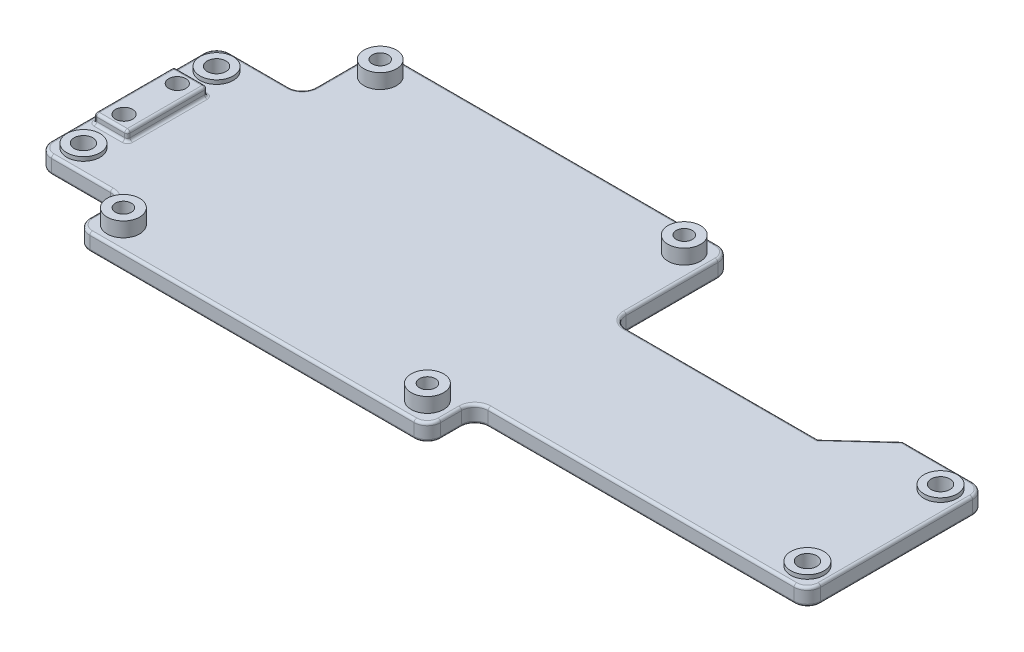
from build123d import *

# Parameters (mm, degrees)
SKETCH1_R             = 1.9304
SKETCH1_R_2           = 1.778
BOSS_EXTRUDE1_DEPTH   = 3.302
SKETCH2_R             = 3.1
SKETCH2_R_2           = 1.52
BOSS_EXTRUDE2_DEPTH   = 2.794
SKETCH3_W             = 6.35
SKETCH3_H             = 15.24
BOSS_EXTRUDE3_DEPTH   = 1.778
F_4_CLEARANCE_HOLE1_D = 3.2639
CUT_EXTRUDE5_DEPTH    = 25.024999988
SKETCH10_R            = 1.9304
CUT_EXTRUDE6_DEPTH    = 3.5
FILLET1_R             = 2.54
FILLET2_R             = 2.54
FILLET3_R             = 2.54
FILLET4_R             = 2.54
FILLET5_R             = 2.54
FILLET6_R             = 2.54
FILLET7_R             = 2.54
FILLET8_R             = 2.54
FILLET9_R             = 2.54
FILLET10_R            = 2.54
FILLET11_R            = 2.54
FILLET12_R            = 2.54
FILLET13_R            = 0.508
SKETCH11_R            = 3.175
SKETCH11_R_2          = 1.778
BOSS_EXTRUDE4_DEPTH   = 0.762


with BuildPart() as part:
    # Sketch1 → Boss-Extrude1 (new body)
    with BuildSketch(Plane(origin=(0, 0, 0), x_dir=(1, 0, 0), z_dir=(0, 1, 0))):
        Polygon((6.38192431, 38.575989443), (22.73952431, 38.575989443), (22.73952431, 53.438389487), (89.680324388, 53.438389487), (89.680324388, 38.575989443), (153.13042431, 38.575989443), (153.13042431, 4.539989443), (89.680324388, 4.539989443), (89.680324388, -4.502410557), (22.73952431, -4.502410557), (22.73952431, 4.539989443), (6.38192431, 4.539989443), align=None)
        with Locations(Location((27.20992431, 48.967989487, 0), (0, 0, 90))):
            Circle(SKETCH1_R, mode=Mode.SUBTRACT)
        with Locations(Location((85.209924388, 48.967989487, 0), (0, 0, 90))):
            Circle(SKETCH1_R, mode=Mode.SUBTRACT)
        with Locations(Location((85.209924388, -0.032010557, 0), (0, 0, 90))):
            Circle(SKETCH1_R, mode=Mode.SUBTRACT)
        with Locations(Location((27.20992431, -0.032010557, 0), (0, 0, 90))):
            Circle(SKETCH1_R, mode=Mode.SUBTRACT)
        with Locations(Location((10.69992431, 34.257989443, 0), (0, 0, 90))):
            Circle(SKETCH1_R_2, mode=Mode.SUBTRACT)
        with Locations(Location((10.69992431, 8.857989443, 0), (0, 0, 90))):
            Circle(SKETCH1_R_2, mode=Mode.SUBTRACT)
        with Locations(Location((148.81242431, 8.857989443, 0), (0, 0, 90))):
            Circle(SKETCH1_R_2, mode=Mode.SUBTRACT)
        with Locations(Location((148.81242431, 34.257989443, 0), (0, 0, 90))):
            Circle(SKETCH1_R_2, mode=Mode.SUBTRACT)
    extrude(amount=BOSS_EXTRUDE1_DEPTH)

    # Sketch2 → Boss-Extrude2 (add)
    # profile 1 of 4: a face of its own
    with BuildSketch(Plane(origin=(0, 3.302, 0), x_dir=(1, 0, 0), z_dir=(0, 1, 0))):
        with Locations(Location((27.20992431, 48.967989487, 0), (0, 0, 90))):
            Circle(SKETCH2_R)
        with Locations(Location((27.20992431, 48.967989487, 0), (0, 0, 270))):
            Circle(SKETCH2_R_2, mode=Mode.SUBTRACT)
    # profile 2 of 4: a face of its own
    with BuildSketch(Plane(origin=(0, 3.302, 0), x_dir=(1, 0, 0), z_dir=(0, 1, 0))):
        with Locations(Location((85.209924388, 48.967989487, 0), (0, 0, 90))):
            Circle(SKETCH2_R)
        with Locations(Location((85.209924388, 48.967989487, 0), (0, 0, 270))):
            Circle(SKETCH2_R_2, mode=Mode.SUBTRACT)
    # profile 3 of 4: a face of its own
    with BuildSketch(Plane(origin=(0, 3.302, 0), x_dir=(1, 0, 0), z_dir=(0, 1, 0))):
        with Locations(Location((27.20992431, -0.032010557, 0), (0, 0, 90))):
            Circle(SKETCH2_R)
        with Locations(Location((27.20992431, -0.032010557, 0), (0, 0, 270))):
            Circle(SKETCH2_R_2, mode=Mode.SUBTRACT)
    # profile 4 of 4: a face of its own
    with BuildSketch(Plane(origin=(0, 3.302, 0), x_dir=(1, 0, 0), z_dir=(0, 1, 0))):
        with Locations(Location((85.209924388, -0.032010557, 0), (0, 0, 90))):
            Circle(SKETCH2_R)
        with Locations(Location((85.209924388, -0.032010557, 0), (0, 0, 270))):
            Circle(SKETCH2_R_2, mode=Mode.SUBTRACT)
    extrude(amount=BOSS_EXTRUDE2_DEPTH)

    # Sketch3 → Boss-Extrude3 (add)
    with BuildSketch(Plane(origin=(0, 3.302, 0), x_dir=(1, 0, 0), z_dir=(0, 1, 0))):
        with Locations((10.82692431, 21.557989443)):
            Rectangle(SKETCH3_W, SKETCH3_H)
    extrude(amount=BOSS_EXTRUDE3_DEPTH)

    # 4 Clearance Hole1 (through all)
    with Locations(Plane(origin=(0, 5.08, 0), x_dir=(1, 0, 0), z_dir=(0, 1, 0))):
        with Locations((10.82692431, 26.637989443), (10.82692431, 16.477989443)):
            Hole(F_4_CLEARANCE_HOLE1_D / 2)

    # Sketch8 → Cut-Extrude5 (cut)
    with BuildSketch(Plane(origin=(0, 3.302, 0), x_dir=(1, 0, 0), z_dir=(0, 1, 0))):
        Polygon((89.680324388, 38.575989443), (89.680324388, 30.872801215), (128.842569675, 30.872801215), (137.272724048, 38.575989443), align=None)
    extrude(amount=-CUT_EXTRUDE5_DEPTH, mode=Mode.SUBTRACT)

    # Sketch10 → Cut-Extrude6 (cut)
    with BuildSketch(Plane.XZ):
        with Locations(Location((27.20992431, 0.032010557, 0), (0, 0, 270))):
            Circle(SKETCH10_R)
        with Locations(Location((85.209924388, 0.032010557, 0), (0, 0, 270))):
            Circle(SKETCH10_R)
        with Locations(Location((85.209924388, -48.967989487, 0), (0, 0, 270))):
            Circle(SKETCH10_R)
        with Locations(Location((27.20992431, -48.967989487, 0), (0, 0, 270))):
            Circle(SKETCH10_R)
    extrude(amount=-CUT_EXTRUDE6_DEPTH, mode=Mode.SUBTRACT)

    # Fillet1
    fillet1_edges = [part.edges().sort_by_distance(p)[0] for p in [
        (6.38192431, 1.651, -4.539989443),
    ]]
    fillet(fillet1_edges, radius=FILLET1_R)

    # Fillet2
    fillet2_edges = [part.edges().sort_by_distance(p)[0] for p in [
        (6.38192431, 1.651, -38.575989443),
    ]]
    fillet(fillet2_edges, radius=FILLET2_R)

    # Fillet3
    fillet3_edges = [part.edges().sort_by_distance(p)[0] for p in [
        (22.73952431, 1.651, -4.539989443),
    ]]
    fillet(fillet3_edges, radius=FILLET3_R)

    # Fillet4
    fillet4_edges = [part.edges().sort_by_distance(p)[0] for p in [
        (22.73952431, 1.651, 4.502410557),
    ]]
    fillet(fillet4_edges, radius=FILLET4_R)

    # Fillet5
    fillet5_edges = [part.edges().sort_by_distance(p)[0] for p in [
        (22.73952431, 1.651, -38.575989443),
    ]]
    fillet(fillet5_edges, radius=FILLET5_R)

    # Fillet6
    fillet6_edges = [part.edges().sort_by_distance(p)[0] for p in [
        (22.73952431, 1.651, -53.438389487),
    ]]
    fillet(fillet6_edges, radius=FILLET6_R)

    # Fillet7
    fillet7_edges = [part.edges().sort_by_distance(p)[0] for p in [
        (89.680324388, 1.651, -53.438389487),
    ]]
    fillet(fillet7_edges, radius=FILLET7_R)

    # Fillet8
    fillet8_edges = [part.edges().sort_by_distance(p)[0] for p in [
        (89.680324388, 1.651, -30.872801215),
    ]]
    fillet(fillet8_edges, radius=FILLET8_R)

    # Fillet9
    fillet9_edges = [part.edges().sort_by_distance(p)[0] for p in [
        (153.13042431, 1.651, -38.575989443),
    ]]
    fillet(fillet9_edges, radius=FILLET9_R)

    # Fillet10
    fillet10_edges = [part.edges().sort_by_distance(p)[0] for p in [
        (153.13042431, 1.651, -4.539989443),
    ]]
    fillet(fillet10_edges, radius=FILLET10_R)

    # Fillet11
    fillet11_edges = [part.edges().sort_by_distance(p)[0] for p in [
        (89.680324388, 1.651, -4.539989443),
    ]]
    fillet(fillet11_edges, radius=FILLET11_R)

    # Fillet12
    fillet12_edges = [part.edges().sort_by_distance(p)[0] for p in [
        (89.680324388, 1.651, 4.502410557),
    ]]
    fillet(fillet12_edges, radius=FILLET12_R)

    # Fillet13
    fillet13_edges = [part.edges().sort_by_distance(p)[0] for p in [
        (7.65192431, 3.302, -21.557989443),
        (7.65192431, 4.191, -29.177989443),
        (10.82692431, 3.302, -13.937989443),
        (7.65192431, 4.191, -13.937989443),
        (14.00192431, 3.302, -21.557989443),
        (14.00192431, 4.191, -13.937989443),
        (10.82692431, 3.302, -29.177989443),
        (14.00192431, 4.191, -29.177989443),
        (7.65192431, 5.08, -21.557989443),
        (10.82692431, 5.08, -13.937989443),
        (14.00192431, 5.08, -21.557989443),
        (10.82692431, 5.08, -29.177989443),
        (110.531447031, 0, -30.872801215),
        (133.057646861, 0, -34.724395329),
        (133.057646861, 3.302, -34.724395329),
        (14.56072431, 0, -4.539989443),
        (14.56072431, 3.302, -4.539989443),
        (7.125873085, 0, -5.283938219),
        (7.125873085, 3.302, -5.283938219),
        (6.38192431, 0, -21.557989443),
        (6.38192431, 3.302, -21.557989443),
        (7.125873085, 3.302, -37.832040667),
        (7.125873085, 0, -37.832040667),
        (22.73952431, 0, -0.018789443),
        (22.73952431, 3.302, -0.018789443),
        (21.995575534, 0, -3.796040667),
        (21.995575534, 3.302, -3.796040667),
        (56.209924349, 0, 4.502410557),
        (56.209924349, 3.302, 4.502410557),
        (23.483473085, 0, 3.758461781),
        (23.483473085, 3.302, 3.758461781),
        (14.56072431, 0, -38.575989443),
        (14.56072431, 3.302, -38.575989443),
        (21.995575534, 3.302, -39.319938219),
        (21.995575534, 0, -39.319938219),
        (22.73952431, 0, -46.007189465),
        (22.73952431, 3.302, -46.007189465),
        (23.483473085, 3.302, -52.694440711),
        (23.483473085, 0, -52.694440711),
        (56.209924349, 0, -53.438389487),
        (56.209924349, 3.302, -53.438389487),
        (88.936375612, 3.302, -52.694440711),
        (88.936375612, 0, -52.694440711),
        (89.680324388, 0, -42.155595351),
        (89.680324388, 3.302, -42.155595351),
        (110.531447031, 3.302, -30.872801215),
        (90.424273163, 3.302, -31.616749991),
        (90.424273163, 0, -31.616749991),
        (143.931574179, 0, -38.575989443),
        (143.931574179, 3.302, -38.575989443),
        (152.386475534, 3.302, -37.832040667),
        (152.386475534, 0, -37.832040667),
        (153.13042431, 0, -21.557989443),
        (153.13042431, 3.302, -21.557989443),
        (152.386475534, 3.302, -5.283938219),
        (152.386475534, 0, -5.283938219),
        (121.405374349, 0, -4.539989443),
        (121.405374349, 3.302, -4.539989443),
        (90.424273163, 3.302, -3.796040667),
        (90.424273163, 0, -3.796040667),
        (89.680324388, 0, -0.018789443),
        (89.680324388, 3.302, -0.018789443),
        (88.936375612, 3.302, 3.758461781),
        (88.936375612, 0, 3.758461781),
    ]]
    fillet(fillet13_edges, radius=FILLET13_R)

    # Sketch11 → Boss-Extrude4 (add)
    # profile 1 of 4: a face of its own
    with BuildSketch(Plane(origin=(0, 3.302, 0), x_dir=(1, 0, 0), z_dir=(0, 1, 0))):
        with Locations(Location((10.69992431, 34.257989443, 0), (0, 0, 90))):
            Circle(SKETCH11_R)
        with Locations(Location((10.69992431, 34.257989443, 0), (0, 0, 90))):
            Circle(SKETCH11_R_2, mode=Mode.SUBTRACT)
    # profile 2 of 4: a face of its own
    with BuildSketch(Plane(origin=(0, 3.302, 0), x_dir=(1, 0, 0), z_dir=(0, 1, 0))):
        with Locations(Location((10.69992431, 8.857989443, 0), (0, 0, 90))):
            Circle(SKETCH11_R)
        with Locations(Location((10.69992431, 8.857989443, 0), (0, 0, 90))):
            Circle(SKETCH11_R_2, mode=Mode.SUBTRACT)
    # profile 3 of 4: a face of its own
    with BuildSketch(Plane(origin=(0, 3.302, 0), x_dir=(1, 0, 0), z_dir=(0, 1, 0))):
        with Locations(Location((148.81242431, 34.257989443, 0), (0, 0, 90))):
            Circle(SKETCH11_R)
        with Locations(Location((148.81242431, 34.257989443, 0), (0, 0, 90))):
            Circle(SKETCH11_R_2, mode=Mode.SUBTRACT)
    # profile 4 of 4: a face of its own
    with BuildSketch(Plane(origin=(0, 3.302, 0), x_dir=(1, 0, 0), z_dir=(0, 1, 0))):
        with Locations(Location((148.81242431, 8.857989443, 0), (0, 0, 90))):
            Circle(SKETCH11_R)
        with Locations(Location((148.81242431, 8.857989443, 0), (0, 0, 90))):
            Circle(SKETCH11_R_2, mode=Mode.SUBTRACT)
    extrude(amount=BOSS_EXTRUDE4_DEPTH)


solid = part.part
